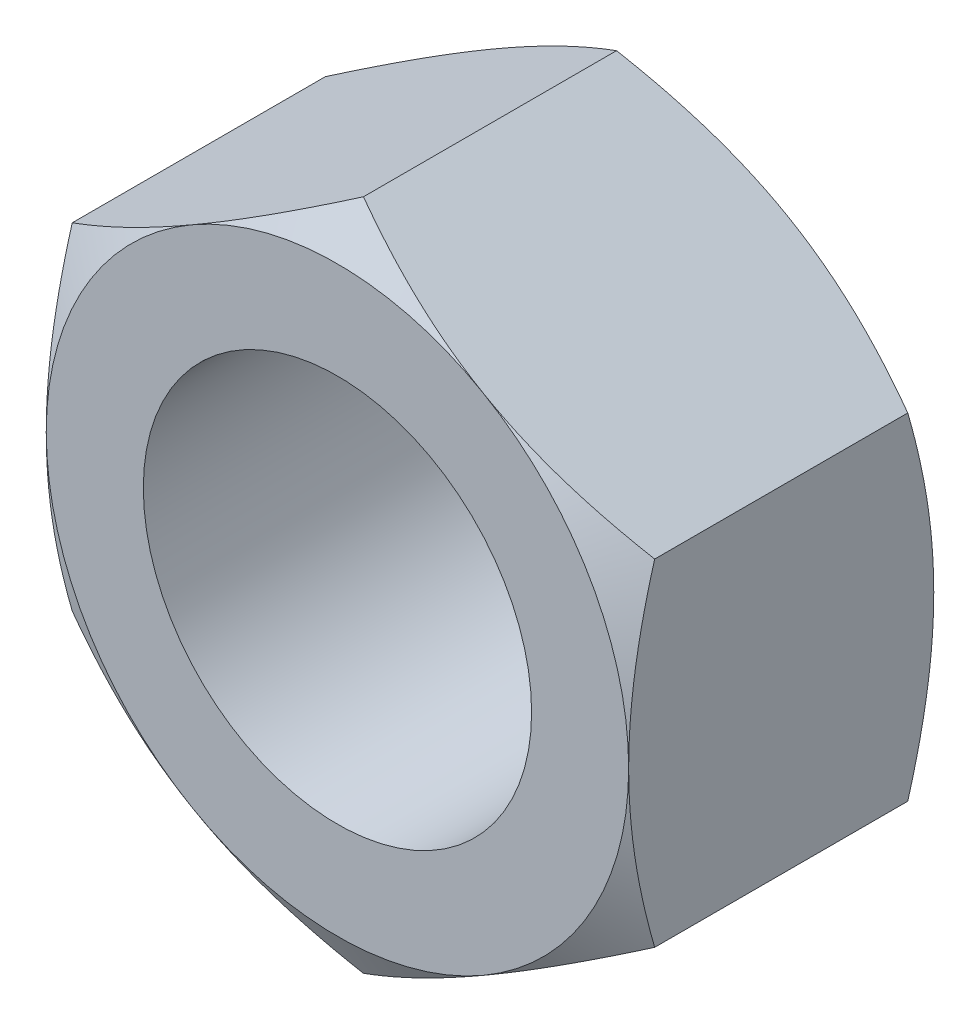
ISO-10303-21;
HEADER;
FILE_DESCRIPTION(('STEP AP214'),'2;1');
FILE_NAME('part.step','',(''),(''),'','','');
FILE_SCHEMA(('AUTOMOTIVE_DESIGN { 1 0 10303 214 1 1 1 1 }'));
ENDSEC;
DATA;
#1=APPLICATION_CONTEXT('core data for automotive mechanical design processes');
#2=APPLICATION_PROTOCOL_DEFINITION('international standard','automotive_design',2000,#1);
#3=PRODUCT_CONTEXT('',#1,'mechanical');
#4=PRODUCT('Part','Part','',(#3));
#5=PRODUCT_RELATED_PRODUCT_CATEGORY('part','',(#4));
#6=PRODUCT_DEFINITION_FORMATION('','',#4);
#7=PRODUCT_DEFINITION_CONTEXT('part definition',#1,'design');
#8=PRODUCT_DEFINITION('design','',#6,#7);
#9=PRODUCT_DEFINITION_SHAPE('','',#8);
#10=(LENGTH_UNIT() NAMED_UNIT(*) SI_UNIT(.MILLI.,.METRE.));
#11=(NAMED_UNIT(*) PLANE_ANGLE_UNIT() SI_UNIT($,.RADIAN.));
#12=(NAMED_UNIT(*) SI_UNIT($,.STERADIAN.) SOLID_ANGLE_UNIT());
#13=UNCERTAINTY_MEASURE_WITH_UNIT(LENGTH_MEASURE(1.E-05),#10,'distance_accuracy_value','');
#14=(GEOMETRIC_REPRESENTATION_CONTEXT(3) GLOBAL_UNCERTAINTY_ASSIGNED_CONTEXT((#13)) GLOBAL_UNIT_ASSIGNED_CONTEXT((#10,
#11,#12)) REPRESENTATION_CONTEXT('',''));
#15=CARTESIAN_POINT('',(0.,0.,0.));
#16=DIRECTION('',(0.,0.,1.));
#17=DIRECTION('',(1.,0.,0.));
#18=AXIS2_PLACEMENT_3D('',#15,#16,#17);
#19=CARTESIAN_POINT('',(-10.5,18.1865334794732,0.));
#20=DIRECTION('',(0.,0.,-1.));
#21=DIRECTION('',(-1.,0.,0.));
#22=AXIS2_PLACEMENT_3D('',#19,#20,#21);
#23=PLANE('',#22);
#24=CARTESIAN_POINT('',(0.,0.,0.));
#25=DIRECTION('',(0.,0.,1.));
#26=DIRECTION('',(1.,0.,0.));
#27=AXIS2_PLACEMENT_3D('',#24,#25,#26);
#28=CIRCLE('',#27,7.);
#29=CARTESIAN_POINT('',(7.,0.,0.));
#30=VERTEX_POINT('',#29);
#31=EDGE_CURVE('E318',#30,#30,#28,.T.);
#32=ORIENTED_EDGE('',*,*,#31,.F.);
#33=EDGE_LOOP('',(#32));
#34=FACE_BOUND('',#33,.T.);
#35=CARTESIAN_POINT('',(0.,0.,0.));
#36=DIRECTION('',(0.,0.,-1.));
#37=DIRECTION('',(-1.,0.,0.));
#38=AXIS2_PLACEMENT_3D('',#35,#36,#37);
#39=CIRCLE('',#38,10.5);
#40=CARTESIAN_POINT('',(-10.5,0.,0.));
#41=VERTEX_POINT('',#40);
#42=CARTESIAN_POINT('',(-5.25,9.09326673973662,0.));
#43=VERTEX_POINT('',#42);
#44=EDGE_CURVE('E326',#41,#43,#39,.T.);
#45=ORIENTED_EDGE('',*,*,#44,.F.);
#46=CARTESIAN_POINT('',(0.,0.,0.));
#47=DIRECTION('',(0.,0.,-1.));
#48=DIRECTION('',(-1.,0.,0.));
#49=AXIS2_PLACEMENT_3D('',#46,#47,#48);
#50=CIRCLE('',#49,10.5);
#51=CARTESIAN_POINT('',(-5.24999999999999,-9.09326673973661,0.));
#52=VERTEX_POINT('',#51);
#53=EDGE_CURVE('E148',#41,#52,#50,.F.);
#54=ORIENTED_EDGE('',*,*,#53,.T.);
#55=CARTESIAN_POINT('',(5.24999999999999,-9.09326673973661,0.));
#56=VERTEX_POINT('',#55);
#57=EDGE_CURVE('E250',#52,#56,#50,.F.);
#58=ORIENTED_EDGE('',*,*,#57,.T.);
#59=CARTESIAN_POINT('',(10.5,0.,0.));
#60=VERTEX_POINT('',#59);
#61=EDGE_CURVE('E151',#56,#60,#50,.F.);
#62=ORIENTED_EDGE('',*,*,#61,.T.);
#63=CARTESIAN_POINT('',(5.24999999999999,9.09326673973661,0.));
#64=VERTEX_POINT('',#63);
#65=EDGE_CURVE('E126',#60,#64,#50,.F.);
#66=ORIENTED_EDGE('',*,*,#65,.T.);
#67=EDGE_CURVE('E139',#64,#43,#50,.F.);
#68=ORIENTED_EDGE('',*,*,#67,.T.);
#69=EDGE_LOOP('',(#45,#54,#58,#62,#66,#68));
#70=FACE_BOUND('',#69,.T.);
#71=ADVANCED_FACE('F31',(#34,#70),#23,.F.);
#72=CARTESIAN_POINT('',(0.,0.,0.));
#73=DIRECTION('',(0.,0.,-1.));
#74=DIRECTION('',(-1.,0.,0.));
#75=AXIS2_PLACEMENT_3D('',#72,#73,#74);
#76=CONICAL_SURFACE('',#75,10.5,1.0471975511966);
#77=CARTESIAN_POINT('',(-10.5,-16.3305051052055,-5.14697612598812));
#78=CARTESIAN_POINT('',(-10.5,-16.1009817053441,-5.03551486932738));
#79=CARTESIAN_POINT('',(-10.5,-15.8711901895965,-4.92460597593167));
#80=CARTESIAN_POINT('',(-10.5,-15.4110149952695,-4.70401794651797));
#81=CARTESIAN_POINT('',(-10.5,-15.1806313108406,-4.59433882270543));
#82=CARTESIAN_POINT('',(-10.5,-14.488447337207,-4.26730501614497));
#83=CARTESIAN_POINT('',(-10.5,-14.0256813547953,-4.05198663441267));
#84=CARTESIAN_POINT('',(-10.5,-13.0945721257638,-3.62692466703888));
#85=CARTESIAN_POINT('',(-10.5,-12.6262122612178,-3.41721739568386));
#86=CARTESIAN_POINT('',(-10.5,-11.6857837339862,-3.00632125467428));
#87=CARTESIAN_POINT('',(-10.5,-11.2137152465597,-2.80513198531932));
#88=CARTESIAN_POINT('',(-10.5,-10.24983556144,-2.40721614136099));
#89=CARTESIAN_POINT('',(-10.5,-9.75787811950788,-2.21084188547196));
#90=CARTESIAN_POINT('',(-10.5,-8.76822664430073,-1.83284251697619));
#91=CARTESIAN_POINT('',(-10.5,-8.27053197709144,-1.65121905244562));
#92=CARTESIAN_POINT('',(-10.5,-7.26952397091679,-1.30745481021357));
#93=CARTESIAN_POINT('',(-10.5,-6.76622417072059,-1.14527503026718));
#94=CARTESIAN_POINT('',(-10.5,-5.75242380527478,-0.845568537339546));
#95=CARTESIAN_POINT('',(-10.5,-5.24192554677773,-0.708034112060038));
#96=CARTESIAN_POINT('',(-10.5,-4.21612600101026,-0.464912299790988));
#97=CARTESIAN_POINT('',(-10.5,-3.70086630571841,-0.359154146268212));
#98=CARTESIAN_POINT('',(-10.5,-2.92324815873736,-0.228919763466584));
#99=CARTESIAN_POINT('',(-10.5,-2.66323567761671,-0.19024040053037));
#100=CARTESIAN_POINT('',(-10.5,-2.14190246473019,-0.123106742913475));
#101=CARTESIAN_POINT('',(-10.5,-1.88058186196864,-0.0946514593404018));
#102=CARTESIAN_POINT('',(-10.5,-1.36041912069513,-0.0488924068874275));
#103=CARTESIAN_POINT('',(-10.5,-1.10158947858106,-0.0314471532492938));
#104=CARTESIAN_POINT('',(-10.5,-0.583424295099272,-0.00752008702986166));
#105=CARTESIAN_POINT('',(-10.5,-0.32408876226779,-0.00103809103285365));
#106=CARTESIAN_POINT('',(-10.5,0.194626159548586,0.000807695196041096));
#107=CARTESIAN_POINT('',(-10.5,0.454005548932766,-0.00382862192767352));
#108=CARTESIAN_POINT('',(-10.5,0.972337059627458,-0.024105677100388));
#109=CARTESIAN_POINT('',(-10.5,1.23128915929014,-0.0397469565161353));
#110=CARTESIAN_POINT('',(-10.5,1.85209820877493,-0.0901048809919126));
#111=CARTESIAN_POINT('',(-10.5,2.21354744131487,-0.129957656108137));
#112=CARTESIAN_POINT('',(-10.5,2.93377792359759,-0.228941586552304));
#113=CARTESIAN_POINT('',(-10.5,3.2925588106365,-0.288075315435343));
#114=CARTESIAN_POINT('',(-10.5,4.36447068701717,-0.491263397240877));
#115=CARTESIAN_POINT('',(-10.5,5.07278568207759,-0.661069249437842));
#116=CARTESIAN_POINT('',(-10.5,6.13220325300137,-0.955778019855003));
#117=CARTESIAN_POINT('',(-10.5,6.48879049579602,-1.06209963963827));
#118=CARTESIAN_POINT('',(-10.5,7.19850081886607,-1.2858394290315));
#119=CARTESIAN_POINT('',(-10.5,7.55162387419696,-1.40325767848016));
#120=CARTESIAN_POINT('',(-10.5,8.25451908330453,-1.64730188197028));
#121=CARTESIAN_POINT('',(-10.5,8.60429226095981,-1.77392491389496));
#122=CARTESIAN_POINT('',(-10.5,9.30093361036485,-2.03488310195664));
#123=CARTESIAN_POINT('',(-10.5,9.64780183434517,-2.16921811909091));
#124=CARTESIAN_POINT('',(-10.5,10.536648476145,-2.52299812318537));
#125=CARTESIAN_POINT('',(-10.5,11.0767414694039,-2.74717417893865));
#126=CARTESIAN_POINT('',(-10.5,12.1517768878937,-3.20759316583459));
#127=CARTESIAN_POINT('',(-10.5,12.6867188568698,-3.44383715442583));
#128=CARTESIAN_POINT('',(-10.5,13.7525527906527,-3.9256958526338));
#129=CARTESIAN_POINT('',(-10.5,14.2834434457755,-4.17131345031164));
#130=CARTESIAN_POINT('',(-10.5,15.3417752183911,-4.66980712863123));
#131=CARTESIAN_POINT('',(-10.5,15.8692164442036,-4.92268297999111));
#132=CARTESIAN_POINT('',(-10.5,16.9220169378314,-5.43454632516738));
#133=CARTESIAN_POINT('',(-10.5,17.4473723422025,-5.69354174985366));
#134=CARTESIAN_POINT('',(-10.5,18.4957707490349,-6.2161724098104));
#135=CARTESIAN_POINT('',(-10.5,19.0188137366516,-6.47980767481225));
#136=CARTESIAN_POINT('',(-10.5,20.0628862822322,-7.01080154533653));
#137=CARTESIAN_POINT('',(-10.5,20.5839161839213,-7.27815947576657));
#138=CARTESIAN_POINT('',(-10.5,21.6243716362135,-7.81598079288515));
#139=CARTESIAN_POINT('',(-10.5,22.1437971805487,-8.0864441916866));
#140=CARTESIAN_POINT('',(-10.5,23.599352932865,-8.84893384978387));
#141=CARTESIAN_POINT('',(-10.5,24.5339618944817,-9.34386369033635));
#142=CARTESIAN_POINT('',(-10.5,26.3999511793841,-10.3398692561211));
#143=CARTESIAN_POINT('',(-10.5,27.3313313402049,-10.8409452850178));
#144=CARTESIAN_POINT('',(-10.5,29.1888362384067,-11.8462361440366));
#145=CARTESIAN_POINT('',(-10.5,30.1149683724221,-12.3504373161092));
#146=CARTESIAN_POINT('',(-10.5,31.5026761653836,-13.1093876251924));
#147=CARTESIAN_POINT('',(-10.5,31.964981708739,-13.3628040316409));
#148=CARTESIAN_POINT('',(-10.5,32.8891570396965,-13.8704287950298));
#149=CARTESIAN_POINT('',(-10.5,33.351026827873,-14.1246371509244));
#150=CARTESIAN_POINT('',(-10.5,33.812704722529,-14.3791936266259));
#151=B_SPLINE_CURVE_WITH_KNOTS('',3,(#77,#78,#79,#80,#81,#82,#83,#84,#85,#86,#87,#88,#89,#90,
#91,#92,#93,#94,#95,#96,#97,#98,#99,#100,#101,#102,#103,#104,#105,#106,#107,#108,#109,#110,#111,
#112,#113,#114,#115,#116,#117,#118,#119,#120,#121,#122,#123,#124,#125,#126,#127,#128,#129,#130,
#131,#132,#133,#134,#135,#136,#137,#138,#139,#140,#141,#142,#143,#144,#145,#146,#147,#148,#149,
#150),.UNSPECIFIED.,.F.,.F.,(4,2,2,2,2,2,2,2,2,2,2,2,2,2,2,2,2,2,2,2,2,2,2,2,2,2,2,2,2,2,2,2,2,
2,2,2,4),(0.,0.765466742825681,1.53094107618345,3.06211405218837,4.60154212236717,
6.14089787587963,7.72982255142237,9.31892451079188,10.904783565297,12.4901454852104,
14.066828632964,14.8552803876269,15.6436558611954,16.4216821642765,17.1996954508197,
17.9777162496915,18.7557753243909,19.8460795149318,20.9365292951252,23.1185841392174,
24.2347912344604,25.3510063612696,26.4668686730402,27.5827108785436,29.3368077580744,
31.0910586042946,32.8458543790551,34.6005947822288,36.3577497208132,38.1149159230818,
39.8717675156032,41.6286259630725,44.8012937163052,47.9741188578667,51.1375644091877,
52.7191821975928,54.3007978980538),.UNSPECIFIED.);
#152=CARTESIAN_POINT('',(-10.5,6.06217782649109,-0.937822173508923));
#153=VERTEX_POINT('',#152);
#154=EDGE_CURVE('E156',#153,#41,#151,.F.);
#155=ORIENTED_EDGE('',*,*,#154,.T.);
#156=ORIENTED_EDGE('',*,*,#44,.T.);
#157=CARTESIAN_POINT('',(0.0002,12.124471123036,-0.937888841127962));
#158=CARTESIAN_POINT('',(-0.230612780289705,11.9912113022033,-0.860963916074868));
#159=CARTESIAN_POINT('',(-0.462286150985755,11.8574546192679,-0.78753038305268));
#160=CARTESIAN_POINT('',(-0.927490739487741,11.588868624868,-0.648614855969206));
#161=CARTESIAN_POINT('',(-1.16102254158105,11.4540389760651,-0.583135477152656));
#162=CARTESIAN_POINT('',(-1.86538084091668,11.0473775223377,-0.399895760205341));
#163=CARTESIAN_POINT('',(-2.33898788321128,10.7739403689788,-0.295669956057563));
#164=CARTESIAN_POINT('',(-3.04771913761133,10.3647541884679,-0.173455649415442));
#165=CARTESIAN_POINT('',(-3.28072597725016,10.2302276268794,-0.138641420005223));
#166=CARTESIAN_POINT('',(-3.74781845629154,9.96055165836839,-0.0802602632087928));
#167=CARTESIAN_POINT('',(-3.98190411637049,9.82540223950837,-0.0566935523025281));
#168=CARTESIAN_POINT('',(-4.45046590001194,9.55487796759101,-0.0214112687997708));
#169=CARTESIAN_POINT('',(-4.68494122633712,9.41950357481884,-0.00968161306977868));
#170=CARTESIAN_POINT('',(-5.15410845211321,9.14862975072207,0.00167731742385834));
#171=CARTESIAN_POINT('',(-5.38880034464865,9.01313032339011,0.00130696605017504));
#172=CARTESIAN_POINT('',(-5.82756124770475,8.75981159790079,-0.0106922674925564));
#173=CARTESIAN_POINT('',(-6.03166122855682,8.64197441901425,-0.0208573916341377));
#174=CARTESIAN_POINT('',(-6.43938384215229,8.40657565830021,-0.0501416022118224));
#175=CARTESIAN_POINT('',(-6.64300644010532,8.28901409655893,-0.0692613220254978));
#176=CARTESIAN_POINT('',(-7.25308524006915,7.93678493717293,-0.139600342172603));
#177=CARTESIAN_POINT('',(-7.65846156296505,7.70274080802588,-0.203790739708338));
#178=CARTESIAN_POINT('',(-8.47351422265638,7.23216993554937,-0.364267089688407));
#179=CARTESIAN_POINT('',(-8.88308654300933,6.99570324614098,-0.461233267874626));
#180=CARTESIAN_POINT('',(-9.6961235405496,6.52629611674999,-0.681306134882));
#181=CARTESIAN_POINT('',(-10.0995986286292,6.29334966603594,-0.804361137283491));
#182=CARTESIAN_POINT('',(-10.5002,6.06206235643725,-0.937888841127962));
#183=B_SPLINE_CURVE_WITH_KNOTS('',3,(#157,#158,#159,#160,#161,#162,#163,#164,#165,#166,#167,
#168,#169,#170,#171,#172,#173,#174,#175,#176,#177,#178,#179,#180,#181,#182),.UNSPECIFIED.,.F.,
.F.,(4,2,2,2,2,2,2,2,2,2,2,2,4),(0.,0.83213025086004,1.66453336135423,3.33288308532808,
4.14658222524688,4.9602970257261,5.77304256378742,6.58576298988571,7.29326708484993,
8.00082123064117,9.4169349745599,10.864454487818,12.3091325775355),.UNSPECIFIED.);
#184=EDGE_CURVE('E188',#43,#153,#183,.T.);
#185=ORIENTED_EDGE('',*,*,#184,.T.);
#186=EDGE_LOOP('',(#155,#156,#185));
#187=FACE_BOUND('',#186,.T.);
#188=ADVANCED_FACE('F175',(#187),#76,.T.);
#189=CARTESIAN_POINT('',(10.5002,6.06206235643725,-0.937888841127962));
#190=CARTESIAN_POINT('',(10.2693872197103,6.19532217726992,-0.860963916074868));
#191=CARTESIAN_POINT('',(10.0377138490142,6.32907886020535,-0.787530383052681));
#192=CARTESIAN_POINT('',(9.57250926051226,6.59766485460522,-0.648614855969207));
#193=CARTESIAN_POINT('',(9.33897745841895,6.73249450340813,-0.583135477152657));
#194=CARTESIAN_POINT('',(8.63461915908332,7.13915595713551,-0.399895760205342));
#195=CARTESIAN_POINT('',(8.16101211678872,7.41259311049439,-0.295669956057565));
#196=CARTESIAN_POINT('',(7.45228086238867,7.82177929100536,-0.173455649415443));
#197=CARTESIAN_POINT('',(7.21927402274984,7.95630585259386,-0.138641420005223));
#198=CARTESIAN_POINT('',(6.75218154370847,8.22598182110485,-0.0802602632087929));
#199=CARTESIAN_POINT('',(6.51809588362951,8.36113123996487,-0.0566935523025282));
#200=CARTESIAN_POINT('',(6.04953409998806,8.63165551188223,-0.0214112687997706));
#201=CARTESIAN_POINT('',(5.81505877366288,8.7670299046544,-0.00968161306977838));
#202=CARTESIAN_POINT('',(5.34589154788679,9.03790372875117,0.00167731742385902));
#203=CARTESIAN_POINT('',(5.11119965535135,9.17340315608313,0.00130696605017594));
#204=CARTESIAN_POINT('',(4.67243875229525,9.42672188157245,-0.0106922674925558));
#205=CARTESIAN_POINT('',(4.46833877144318,9.54455906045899,-0.0208573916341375));
#206=CARTESIAN_POINT('',(4.06061615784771,9.77995782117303,-0.0501416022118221));
#207=CARTESIAN_POINT('',(3.85699355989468,9.89751938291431,-0.0692613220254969));
#208=CARTESIAN_POINT('',(3.24691475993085,10.2497485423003,-0.139600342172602));
#209=CARTESIAN_POINT('',(2.84153843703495,10.4837926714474,-0.203790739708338));
#210=CARTESIAN_POINT('',(2.02648577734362,10.9543635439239,-0.364267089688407));
#211=CARTESIAN_POINT('',(1.61691345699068,11.1908302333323,-0.461233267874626));
#212=CARTESIAN_POINT('',(0.803876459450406,11.6602373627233,-0.681306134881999));
#213=CARTESIAN_POINT('',(0.400401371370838,11.8931838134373,-0.80436113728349));
#214=CARTESIAN_POINT('',(-0.000199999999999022,12.124471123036,-0.937888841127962));
#215=B_SPLINE_CURVE_WITH_KNOTS('',3,(#189,#190,#191,#192,#193,#194,#195,#196,#197,#198,#199,
#200,#201,#202,#203,#204,#205,#206,#207,#208,#209,#210,#211,#212,#213,#214),.UNSPECIFIED.,.F.,
.F.,(4,2,2,2,2,2,2,2,2,2,2,2,4),(0.,0.832130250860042,1.66453336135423,3.33288308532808,
4.14658222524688,4.9602970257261,5.77304256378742,6.58576298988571,7.29326708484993,
8.00082123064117,9.4169349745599,10.864454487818,12.3091325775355),.UNSPECIFIED.);
#216=CARTESIAN_POINT('',(0.,12.1243556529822,-0.937822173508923));
#217=VERTEX_POINT('',#216);
#218=EDGE_CURVE('E135',#64,#217,#215,.T.);
#219=ORIENTED_EDGE('',*,*,#218,.T.);
#220=EDGE_CURVE('E142',#217,#43,#183,.T.);
#221=ORIENTED_EDGE('',*,*,#220,.T.);
#222=ORIENTED_EDGE('',*,*,#67,.F.);
#223=EDGE_LOOP('',(#219,#221,#222));
#224=FACE_BOUND('',#223,.T.);
#225=ADVANCED_FACE('F140',(#224),#76,.T.);
#226=CARTESIAN_POINT('',(10.5,-16.3305051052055,-5.14697612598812));
#227=CARTESIAN_POINT('',(10.5,-16.1009817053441,-5.03551486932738));
#228=CARTESIAN_POINT('',(10.5,-15.8711901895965,-4.92460597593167));
#229=CARTESIAN_POINT('',(10.5,-15.4110149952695,-4.70401794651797));
#230=CARTESIAN_POINT('',(10.5,-15.1806313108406,-4.59433882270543));
#231=CARTESIAN_POINT('',(10.5,-14.488447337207,-4.26730501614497));
#232=CARTESIAN_POINT('',(10.5,-14.0256813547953,-4.05198663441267));
#233=CARTESIAN_POINT('',(10.5,-13.0945721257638,-3.62692466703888));
#234=CARTESIAN_POINT('',(10.5,-12.6262122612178,-3.41721739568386));
#235=CARTESIAN_POINT('',(10.5,-11.6857837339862,-3.00632125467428));
#236=CARTESIAN_POINT('',(10.5,-11.2137152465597,-2.80513198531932));
#237=CARTESIAN_POINT('',(10.5,-10.24983556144,-2.40721614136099));
#238=CARTESIAN_POINT('',(10.5,-9.75787811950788,-2.21084188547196));
#239=CARTESIAN_POINT('',(10.5,-8.76822664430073,-1.83284251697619));
#240=CARTESIAN_POINT('',(10.5,-8.27053197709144,-1.65121905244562));
#241=CARTESIAN_POINT('',(10.5,-7.26952397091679,-1.30745481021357));
#242=CARTESIAN_POINT('',(10.5,-6.76622417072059,-1.14527503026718));
#243=CARTESIAN_POINT('',(10.5,-5.75242380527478,-0.845568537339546));
#244=CARTESIAN_POINT('',(10.5,-5.24192554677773,-0.708034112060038));
#245=CARTESIAN_POINT('',(10.5,-4.21612600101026,-0.464912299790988));
#246=CARTESIAN_POINT('',(10.5,-3.70086630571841,-0.359154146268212));
#247=CARTESIAN_POINT('',(10.5,-2.92324815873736,-0.228919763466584));
#248=CARTESIAN_POINT('',(10.5,-2.66323567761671,-0.19024040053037));
#249=CARTESIAN_POINT('',(10.5,-2.14190246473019,-0.123106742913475));
#250=CARTESIAN_POINT('',(10.5,-1.88058186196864,-0.0946514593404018));
#251=CARTESIAN_POINT('',(10.5,-1.36041912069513,-0.0488924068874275));
#252=CARTESIAN_POINT('',(10.5,-1.10158947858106,-0.0314471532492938));
#253=CARTESIAN_POINT('',(10.5,-0.583424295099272,-0.00752008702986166));
#254=CARTESIAN_POINT('',(10.5,-0.32408876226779,-0.00103809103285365));
#255=CARTESIAN_POINT('',(10.5,0.194626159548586,0.000807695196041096));
#256=CARTESIAN_POINT('',(10.5,0.454005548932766,-0.00382862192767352));
#257=CARTESIAN_POINT('',(10.5,0.972337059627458,-0.024105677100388));
#258=CARTESIAN_POINT('',(10.5,1.23128915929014,-0.0397469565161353));
#259=CARTESIAN_POINT('',(10.5,1.85209820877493,-0.0901048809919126));
#260=CARTESIAN_POINT('',(10.5,2.21354744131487,-0.129957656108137));
#261=CARTESIAN_POINT('',(10.5,2.93377792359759,-0.228941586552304));
#262=CARTESIAN_POINT('',(10.5,3.2925588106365,-0.288075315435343));
#263=CARTESIAN_POINT('',(10.5,4.36447068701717,-0.491263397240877));
#264=CARTESIAN_POINT('',(10.5,5.07278568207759,-0.661069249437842));
#265=CARTESIAN_POINT('',(10.5,6.13220325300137,-0.955778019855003));
#266=CARTESIAN_POINT('',(10.5,6.48879049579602,-1.06209963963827));
#267=CARTESIAN_POINT('',(10.5,7.19850081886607,-1.2858394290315));
#268=CARTESIAN_POINT('',(10.5,7.55162387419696,-1.40325767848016));
#269=CARTESIAN_POINT('',(10.5,8.25451908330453,-1.64730188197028));
#270=CARTESIAN_POINT('',(10.5,8.60429226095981,-1.77392491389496));
#271=CARTESIAN_POINT('',(10.5,9.30093361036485,-2.03488310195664));
#272=CARTESIAN_POINT('',(10.5,9.64780183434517,-2.16921811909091));
#273=CARTESIAN_POINT('',(10.5,10.536648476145,-2.52299812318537));
#274=CARTESIAN_POINT('',(10.5,11.0767414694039,-2.74717417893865));
#275=CARTESIAN_POINT('',(10.5,12.1517768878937,-3.20759316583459));
#276=CARTESIAN_POINT('',(10.5,12.6867188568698,-3.44383715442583));
#277=CARTESIAN_POINT('',(10.5,13.7525527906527,-3.9256958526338));
#278=CARTESIAN_POINT('',(10.5,14.2834434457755,-4.17131345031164));
#279=CARTESIAN_POINT('',(10.5,15.3417752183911,-4.66980712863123));
#280=CARTESIAN_POINT('',(10.5,15.8692164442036,-4.92268297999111));
#281=CARTESIAN_POINT('',(10.5,16.9220169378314,-5.43454632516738));
#282=CARTESIAN_POINT('',(10.5,17.4473723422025,-5.69354174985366));
#283=CARTESIAN_POINT('',(10.5,18.4957707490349,-6.2161724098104));
#284=CARTESIAN_POINT('',(10.5,19.0188137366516,-6.47980767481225));
#285=CARTESIAN_POINT('',(10.5,20.0628862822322,-7.01080154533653));
#286=CARTESIAN_POINT('',(10.5,20.5839161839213,-7.27815947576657));
#287=CARTESIAN_POINT('',(10.5,21.6243716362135,-7.81598079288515));
#288=CARTESIAN_POINT('',(10.5,22.1437971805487,-8.0864441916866));
#289=CARTESIAN_POINT('',(10.5,23.599352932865,-8.84893384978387));
#290=CARTESIAN_POINT('',(10.5,24.5339618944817,-9.34386369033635));
#291=CARTESIAN_POINT('',(10.5,26.3999511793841,-10.3398692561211));
#292=CARTESIAN_POINT('',(10.5,27.3313313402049,-10.8409452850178));
#293=CARTESIAN_POINT('',(10.5,29.1888362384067,-11.8462361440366));
#294=CARTESIAN_POINT('',(10.5,30.1149683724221,-12.3504373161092));
#295=CARTESIAN_POINT('',(10.5,31.5026761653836,-13.1093876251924));
#296=CARTESIAN_POINT('',(10.5,31.964981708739,-13.3628040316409));
#297=CARTESIAN_POINT('',(10.5,32.8891570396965,-13.8704287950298));
#298=CARTESIAN_POINT('',(10.5,33.351026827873,-14.1246371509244));
#299=CARTESIAN_POINT('',(10.5,33.812704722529,-14.3791936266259));
#300=B_SPLINE_CURVE_WITH_KNOTS('',3,(#226,#227,#228,#229,#230,#231,#232,#233,#234,#235,#236,
#237,#238,#239,#240,#241,#242,#243,#244,#245,#246,#247,#248,#249,#250,#251,#252,#253,#254,#255,
#256,#257,#258,#259,#260,#261,#262,#263,#264,#265,#266,#267,#268,#269,#270,#271,#272,#273,#274,
#275,#276,#277,#278,#279,#280,#281,#282,#283,#284,#285,#286,#287,#288,#289,#290,#291,#292,#293,
#294,#295,#296,#297,#298,#299),.UNSPECIFIED.,.F.,.F.,(4,2,2,2,2,2,2,2,2,2,2,2,2,2,2,2,2,2,2,2,2,
2,2,2,2,2,2,2,2,2,2,2,2,2,2,2,4),(0.,0.765466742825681,1.53094107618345,3.06211405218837,
4.60154212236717,6.14089787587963,7.72982255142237,9.31892451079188,10.904783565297,
12.4901454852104,14.066828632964,14.8552803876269,15.6436558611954,16.4216821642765,
17.1996954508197,17.9777162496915,18.7557753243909,19.8460795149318,20.9365292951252,
23.1185841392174,24.2347912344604,25.3510063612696,26.4668686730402,27.5827108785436,
29.3368077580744,31.0910586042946,32.8458543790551,34.6005947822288,36.3577497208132,
38.1149159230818,39.8717675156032,41.6286259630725,44.8012937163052,47.9741188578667,
51.1375644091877,52.7191821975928,54.3007978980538),.UNSPECIFIED.);
#301=CARTESIAN_POINT('',(10.5,6.06217782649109,-0.937822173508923));
#302=VERTEX_POINT('',#301);
#303=EDGE_CURVE('E129',#60,#302,#300,.T.);
#304=ORIENTED_EDGE('',*,*,#303,.T.);
#305=EDGE_CURVE('E122',#302,#64,#215,.T.);
#306=ORIENTED_EDGE('',*,*,#305,.T.);
#307=ORIENTED_EDGE('',*,*,#65,.F.);
#308=EDGE_LOOP('',(#304,#306,#307));
#309=FACE_BOUND('',#308,.T.);
#310=ADVANCED_FACE('F124',(#309),#76,.T.);
#311=CARTESIAN_POINT('',(-0.0002,-12.124471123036,-0.937888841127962));
#312=CARTESIAN_POINT('',(0.230612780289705,-11.9912113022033,-0.860963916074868));
#313=CARTESIAN_POINT('',(0.462286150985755,-11.8574546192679,-0.78753038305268));
#314=CARTESIAN_POINT('',(0.927490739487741,-11.588868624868,-0.648614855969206));
#315=CARTESIAN_POINT('',(1.16102254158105,-11.4540389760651,-0.583135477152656));
#316=CARTESIAN_POINT('',(1.86538084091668,-11.0473775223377,-0.399895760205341));
#317=CARTESIAN_POINT('',(2.33898788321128,-10.7739403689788,-0.295669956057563));
#318=CARTESIAN_POINT('',(3.04771913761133,-10.3647541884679,-0.173455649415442));
#319=CARTESIAN_POINT('',(3.28072597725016,-10.2302276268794,-0.138641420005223));
#320=CARTESIAN_POINT('',(3.74781845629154,-9.96055165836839,-0.0802602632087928));
#321=CARTESIAN_POINT('',(3.98190411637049,-9.82540223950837,-0.0566935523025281));
#322=CARTESIAN_POINT('',(4.45046590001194,-9.55487796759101,-0.0214112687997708));
#323=CARTESIAN_POINT('',(4.68494122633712,-9.41950357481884,-0.00968161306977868));
#324=CARTESIAN_POINT('',(5.15410845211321,-9.14862975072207,0.00167731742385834));
#325=CARTESIAN_POINT('',(5.38880034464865,-9.01313032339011,0.00130696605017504));
#326=CARTESIAN_POINT('',(5.82756124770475,-8.75981159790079,-0.0106922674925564));
#327=CARTESIAN_POINT('',(6.03166122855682,-8.64197441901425,-0.0208573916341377));
#328=CARTESIAN_POINT('',(6.43938384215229,-8.40657565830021,-0.0501416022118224));
#329=CARTESIAN_POINT('',(6.64300644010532,-8.28901409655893,-0.0692613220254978));
#330=CARTESIAN_POINT('',(7.25308524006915,-7.93678493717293,-0.139600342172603));
#331=CARTESIAN_POINT('',(7.65846156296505,-7.70274080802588,-0.203790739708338));
#332=CARTESIAN_POINT('',(8.47351422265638,-7.23216993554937,-0.364267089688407));
#333=CARTESIAN_POINT('',(8.88308654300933,-6.99570324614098,-0.461233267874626));
#334=CARTESIAN_POINT('',(9.6961235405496,-6.52629611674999,-0.681306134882));
#335=CARTESIAN_POINT('',(10.0995986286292,-6.29334966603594,-0.804361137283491));
#336=CARTESIAN_POINT('',(10.5002,-6.06206235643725,-0.937888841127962));
#337=B_SPLINE_CURVE_WITH_KNOTS('',3,(#311,#312,#313,#314,#315,#316,#317,#318,#319,#320,#321,
#322,#323,#324,#325,#326,#327,#328,#329,#330,#331,#332,#333,#334,#335,#336),.UNSPECIFIED.,.F.,
.F.,(4,2,2,2,2,2,2,2,2,2,2,2,4),(0.,0.83213025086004,1.66453336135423,3.33288308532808,
4.14658222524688,4.9602970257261,5.77304256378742,6.58576298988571,7.29326708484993,
8.00082123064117,9.4169349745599,10.864454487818,12.3091325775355),.UNSPECIFIED.);
#338=CARTESIAN_POINT('',(10.5,-6.06217782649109,-0.937822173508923));
#339=VERTEX_POINT('',#338);
#340=EDGE_CURVE('E202',#56,#339,#337,.T.);
#341=ORIENTED_EDGE('',*,*,#340,.T.);
#342=EDGE_CURVE('E201',#339,#60,#300,.T.);
#343=ORIENTED_EDGE('',*,*,#342,.T.);
#344=ORIENTED_EDGE('',*,*,#61,.F.);
#345=EDGE_LOOP('',(#341,#343,#344));
#346=FACE_BOUND('',#345,.T.);
#347=ADVANCED_FACE('F426',(#346),#76,.T.);
#348=CARTESIAN_POINT('',(0.,-12.1243556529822,-0.937822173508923));
#349=VERTEX_POINT('',#348);
#350=EDGE_CURVE('E260',#349,#56,#337,.T.);
#351=ORIENTED_EDGE('',*,*,#350,.T.);
#352=ORIENTED_EDGE('',*,*,#57,.F.);
#353=CARTESIAN_POINT('',(-10.5002,-6.06206235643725,-0.937888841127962));
#354=CARTESIAN_POINT('',(-10.2693872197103,-6.19532217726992,-0.860963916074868));
#355=CARTESIAN_POINT('',(-10.0377138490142,-6.32907886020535,-0.787530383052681));
#356=CARTESIAN_POINT('',(-9.57250926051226,-6.59766485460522,-0.648614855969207));
#357=CARTESIAN_POINT('',(-9.33897745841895,-6.73249450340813,-0.583135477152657));
#358=CARTESIAN_POINT('',(-8.63461915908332,-7.13915595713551,-0.399895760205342));
#359=CARTESIAN_POINT('',(-8.16101211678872,-7.41259311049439,-0.295669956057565));
#360=CARTESIAN_POINT('',(-7.45228086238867,-7.82177929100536,-0.173455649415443));
#361=CARTESIAN_POINT('',(-7.21927402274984,-7.95630585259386,-0.138641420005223));
#362=CARTESIAN_POINT('',(-6.75218154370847,-8.22598182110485,-0.0802602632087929));
#363=CARTESIAN_POINT('',(-6.51809588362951,-8.36113123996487,-0.0566935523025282));
#364=CARTESIAN_POINT('',(-6.04953409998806,-8.63165551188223,-0.0214112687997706));
#365=CARTESIAN_POINT('',(-5.81505877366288,-8.7670299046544,-0.00968161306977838));
#366=CARTESIAN_POINT('',(-5.34589154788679,-9.03790372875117,0.00167731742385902));
#367=CARTESIAN_POINT('',(-5.11119965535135,-9.17340315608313,0.00130696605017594));
#368=CARTESIAN_POINT('',(-4.67243875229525,-9.42672188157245,-0.0106922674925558));
#369=CARTESIAN_POINT('',(-4.46833877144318,-9.54455906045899,-0.0208573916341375));
#370=CARTESIAN_POINT('',(-4.06061615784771,-9.77995782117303,-0.0501416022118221));
#371=CARTESIAN_POINT('',(-3.85699355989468,-9.89751938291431,-0.0692613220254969));
#372=CARTESIAN_POINT('',(-3.24691475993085,-10.2497485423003,-0.139600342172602));
#373=CARTESIAN_POINT('',(-2.84153843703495,-10.4837926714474,-0.203790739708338));
#374=CARTESIAN_POINT('',(-2.02648577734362,-10.9543635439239,-0.364267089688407));
#375=CARTESIAN_POINT('',(-1.61691345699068,-11.1908302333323,-0.461233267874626));
#376=CARTESIAN_POINT('',(-0.803876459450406,-11.6602373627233,-0.681306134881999));
#377=CARTESIAN_POINT('',(-0.400401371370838,-11.8931838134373,-0.80436113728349));
#378=CARTESIAN_POINT('',(0.000199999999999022,-12.124471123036,-0.937888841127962));
#379=B_SPLINE_CURVE_WITH_KNOTS('',3,(#353,#354,#355,#356,#357,#358,#359,#360,#361,#362,#363,
#364,#365,#366,#367,#368,#369,#370,#371,#372,#373,#374,#375,#376,#377,#378),.UNSPECIFIED.,.F.,
.F.,(4,2,2,2,2,2,2,2,2,2,2,2,4),(0.,0.832130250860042,1.66453336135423,3.33288308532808,
4.14658222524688,4.9602970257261,5.77304256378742,6.58576298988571,7.29326708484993,
8.00082123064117,9.4169349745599,10.864454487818,12.3091325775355),.UNSPECIFIED.);
#380=EDGE_CURVE('E264',#52,#349,#379,.T.);
#381=ORIENTED_EDGE('',*,*,#380,.T.);
#382=EDGE_LOOP('',(#351,#352,#381));
#383=FACE_BOUND('',#382,.T.);
#384=ADVANCED_FACE('F181',(#383),#76,.T.);
#385=CARTESIAN_POINT('',(-10.5,-6.06217782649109,-0.937822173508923));
#386=VERTEX_POINT('',#385);
#387=EDGE_CURVE('E169',#386,#52,#379,.T.);
#388=ORIENTED_EDGE('',*,*,#387,.T.);
#389=ORIENTED_EDGE('',*,*,#53,.F.);
#390=EDGE_CURVE('E134',#41,#386,#151,.F.);
#391=ORIENTED_EDGE('',*,*,#390,.T.);
#392=EDGE_LOOP('',(#388,#389,#391));
#393=FACE_BOUND('',#392,.T.);
#394=ADVANCED_FACE('F269',(#393),#76,.T.);
#395=CARTESIAN_POINT('',(10.5,6.06217782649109,-11.));
#396=DIRECTION('',(0.499999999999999,0.866025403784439,0.));
#397=DIRECTION('',(-0.866025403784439,0.499999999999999,0.));
#398=AXIS2_PLACEMENT_3D('',#395,#396,#397);
#399=PLANE('',#398);
#400=CARTESIAN_POINT('',(-0.0002,12.124471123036,-10.062111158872));
#401=CARTESIAN_POINT('',(0.230612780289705,11.9912113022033,-10.1390360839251));
#402=CARTESIAN_POINT('',(0.462286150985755,11.8574546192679,-10.2124696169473));
#403=CARTESIAN_POINT('',(0.927490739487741,11.588868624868,-10.3513851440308));
#404=CARTESIAN_POINT('',(1.16102254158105,11.4540389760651,-10.4168645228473));
#405=CARTESIAN_POINT('',(1.86538084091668,11.0473775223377,-10.6001042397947));
#406=CARTESIAN_POINT('',(2.33898788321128,10.7739403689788,-10.7043300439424));
#407=CARTESIAN_POINT('',(3.04771913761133,10.3647541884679,-10.8265443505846));
#408=CARTESIAN_POINT('',(3.28072597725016,10.2302276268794,-10.8613585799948));
#409=CARTESIAN_POINT('',(3.74781845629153,9.96055165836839,-10.9197397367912));
#410=CARTESIAN_POINT('',(3.98190411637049,9.82540223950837,-10.9433064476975));
#411=CARTESIAN_POINT('',(4.45046590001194,9.55487796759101,-10.9785887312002));
#412=CARTESIAN_POINT('',(4.68494122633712,9.41950357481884,-10.9903183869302));
#413=CARTESIAN_POINT('',(5.15410845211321,9.14862975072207,-11.0016773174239));
#414=CARTESIAN_POINT('',(5.38880034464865,9.01313032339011,-11.0013069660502));
#415=CARTESIAN_POINT('',(5.82756124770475,8.75981159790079,-10.9893077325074));
#416=CARTESIAN_POINT('',(6.03166122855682,8.64197441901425,-10.9791426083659));
#417=CARTESIAN_POINT('',(6.43938384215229,8.40657565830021,-10.9498583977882));
#418=CARTESIAN_POINT('',(6.64300644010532,8.28901409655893,-10.9307386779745));
#419=CARTESIAN_POINT('',(7.25308524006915,7.93678493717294,-10.8603996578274));
#420=CARTESIAN_POINT('',(7.65846156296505,7.70274080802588,-10.7962092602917));
#421=CARTESIAN_POINT('',(8.47351422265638,7.23216993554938,-10.6357329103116));
#422=CARTESIAN_POINT('',(8.88308654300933,6.99570324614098,-10.5387667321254));
#423=CARTESIAN_POINT('',(9.69612354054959,6.52629611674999,-10.318693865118));
#424=CARTESIAN_POINT('',(10.0995986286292,6.29334966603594,-10.1956388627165));
#425=CARTESIAN_POINT('',(10.5002,6.06206235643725,-10.062111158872));
#426=B_SPLINE_CURVE_WITH_KNOTS('',3,(#400,#401,#402,#403,#404,#405,#406,#407,#408,#409,#410,
#411,#412,#413,#414,#415,#416,#417,#418,#419,#420,#421,#422,#423,#424,#425),.UNSPECIFIED.,.F.,
.F.,(4,2,2,2,2,2,2,2,2,2,2,2,4),(0.,0.832130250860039,1.66453336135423,3.33288308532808,
4.14658222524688,4.9602970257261,5.77304256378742,6.58576298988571,7.29326708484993,
8.00082123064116,9.4169349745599,10.864454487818,12.3091325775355),.UNSPECIFIED.);
#427=CARTESIAN_POINT('',(0.,12.1243556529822,-10.0621778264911));
#428=VERTEX_POINT('',#427);
#429=CARTESIAN_POINT('',(5.24999999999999,9.09326673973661,-11.));
#430=VERTEX_POINT('',#429);
#431=EDGE_CURVE('E235',#428,#430,#426,.T.);
#432=ORIENTED_EDGE('',*,*,#431,.F.);
#433=DIRECTION('',(0.,0.,1.));
#434=VECTOR('',#433,1.);
#435=CARTESIAN_POINT('',(0.,12.1243556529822,-11.));
#436=LINE('',#435,#434);
#437=EDGE_CURVE('E155',#428,#217,#436,.T.);
#438=ORIENTED_EDGE('',*,*,#437,.T.);
#439=ORIENTED_EDGE('',*,*,#218,.F.);
#440=ORIENTED_EDGE('',*,*,#305,.F.);
#441=DIRECTION('',(0.,0.,1.));
#442=VECTOR('',#441,1.);
#443=CARTESIAN_POINT('',(10.5,6.06217782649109,-11.));
#444=LINE('',#443,#442);
#445=CARTESIAN_POINT('',(10.5,6.06217782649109,-10.0621778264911));
#446=VERTEX_POINT('',#445);
#447=EDGE_CURVE('E147',#446,#302,#444,.T.);
#448=ORIENTED_EDGE('',*,*,#447,.F.);
#449=EDGE_CURVE('E230',#430,#446,#426,.T.);
#450=ORIENTED_EDGE('',*,*,#449,.F.);
#451=EDGE_LOOP('',(#432,#438,#439,#440,#448,#450));
#452=FACE_BOUND('',#451,.T.);
#453=ADVANCED_FACE('F33',(#452),#399,.T.);
#454=CARTESIAN_POINT('',(10.5,-6.06217782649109,-11.));
#455=DIRECTION('',(1.,0.,0.));
#456=DIRECTION('',(0.,0.,-1.));
#457=AXIS2_PLACEMENT_3D('',#454,#455,#456);
#458=PLANE('',#457);
#459=CARTESIAN_POINT('',(10.5,-16.3305051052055,-5.85302387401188));
#460=CARTESIAN_POINT('',(10.5,-16.1009817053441,-5.96448513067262));
#461=CARTESIAN_POINT('',(10.5,-15.8711901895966,-6.07539402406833));
#462=CARTESIAN_POINT('',(10.5,-15.4110149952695,-6.29598205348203));
#463=CARTESIAN_POINT('',(10.5,-15.1806313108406,-6.40566117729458));
#464=CARTESIAN_POINT('',(10.5,-14.488447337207,-6.73269498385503));
#465=CARTESIAN_POINT('',(10.5,-14.0256813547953,-6.94801336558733));
#466=CARTESIAN_POINT('',(10.5,-13.0945721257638,-7.37307533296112));
#467=CARTESIAN_POINT('',(10.5,-12.6262122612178,-7.58278260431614));
#468=CARTESIAN_POINT('',(10.5,-11.6857837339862,-7.99367874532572));
#469=CARTESIAN_POINT('',(10.5,-11.2137152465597,-8.19486801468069));
#470=CARTESIAN_POINT('',(10.5,-10.24983556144,-8.59278385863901));
#471=CARTESIAN_POINT('',(10.5,-9.75787811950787,-8.78915811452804));
#472=CARTESIAN_POINT('',(10.5,-8.76822664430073,-9.16715748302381));
#473=CARTESIAN_POINT('',(10.5,-8.27053197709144,-9.34878094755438));
#474=CARTESIAN_POINT('',(10.5,-7.26952397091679,-9.69254518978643));
#475=CARTESIAN_POINT('',(10.5,-6.7662241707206,-9.85472496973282));
#476=CARTESIAN_POINT('',(10.5,-5.75242380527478,-10.1544314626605));
#477=CARTESIAN_POINT('',(10.5,-5.24192554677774,-10.29196588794));
#478=CARTESIAN_POINT('',(10.5,-4.21612600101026,-10.535087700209));
#479=CARTESIAN_POINT('',(10.5,-3.70086630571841,-10.6408458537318));
#480=CARTESIAN_POINT('',(10.5,-2.92324815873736,-10.7710802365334));
#481=CARTESIAN_POINT('',(10.5,-2.66323567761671,-10.8097595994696));
#482=CARTESIAN_POINT('',(10.5,-2.14190246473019,-10.8768932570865));
#483=CARTESIAN_POINT('',(10.5,-1.88058186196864,-10.9053485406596));
#484=CARTESIAN_POINT('',(10.5,-1.36041912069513,-10.9511075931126));
#485=CARTESIAN_POINT('',(10.5,-1.10158947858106,-10.9685528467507));
#486=CARTESIAN_POINT('',(10.5,-0.583424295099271,-10.9924799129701));
#487=CARTESIAN_POINT('',(10.5,-0.324088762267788,-10.9989619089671));
#488=CARTESIAN_POINT('',(10.5,0.194626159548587,-11.000807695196));
#489=CARTESIAN_POINT('',(10.5,0.454005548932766,-10.9961713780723));
#490=CARTESIAN_POINT('',(10.5,0.972337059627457,-10.9758943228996));
#491=CARTESIAN_POINT('',(10.5,1.23128915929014,-10.9602530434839));
#492=CARTESIAN_POINT('',(10.5,1.85209820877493,-10.9098951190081));
#493=CARTESIAN_POINT('',(10.5,2.21354744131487,-10.8700423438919));
#494=CARTESIAN_POINT('',(10.5,2.93377792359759,-10.7710584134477));
#495=CARTESIAN_POINT('',(10.5,3.29255881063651,-10.7119246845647));
#496=CARTESIAN_POINT('',(10.5,4.36447068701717,-10.5087366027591));
#497=CARTESIAN_POINT('',(10.5,5.07278568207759,-10.3389307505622));
#498=CARTESIAN_POINT('',(10.5,6.13220325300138,-10.044221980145));
#499=CARTESIAN_POINT('',(10.5,6.48879049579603,-9.93790036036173));
#500=CARTESIAN_POINT('',(10.5,7.19850081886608,-9.7141605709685));
#501=CARTESIAN_POINT('',(10.5,7.55162387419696,-9.59674232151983));
#502=CARTESIAN_POINT('',(10.5,8.25451908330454,-9.35269811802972));
#503=CARTESIAN_POINT('',(10.5,8.60429226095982,-9.22607508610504));
#504=CARTESIAN_POINT('',(10.5,9.30093361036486,-8.96511689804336));
#505=CARTESIAN_POINT('',(10.5,9.64780183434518,-8.83078188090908));
#506=CARTESIAN_POINT('',(10.5,10.5366484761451,-8.47700187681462));
#507=CARTESIAN_POINT('',(10.5,11.0767414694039,-8.25282582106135));
#508=CARTESIAN_POINT('',(10.5,12.1517768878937,-7.7924068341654));
#509=CARTESIAN_POINT('',(10.5,12.6867188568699,-7.55616284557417));
#510=CARTESIAN_POINT('',(10.5,13.7525527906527,-7.0743041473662));
#511=CARTESIAN_POINT('',(10.5,14.2834434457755,-6.82868654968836));
#512=CARTESIAN_POINT('',(10.5,15.3417752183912,-6.33019287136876));
#513=CARTESIAN_POINT('',(10.5,15.8692164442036,-6.07731702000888));
#514=CARTESIAN_POINT('',(10.5,16.9220169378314,-5.56545367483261));
#515=CARTESIAN_POINT('',(10.5,17.4473723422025,-5.30645825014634));
#516=CARTESIAN_POINT('',(10.5,18.4957707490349,-4.7838275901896));
#517=CARTESIAN_POINT('',(10.5,19.0188137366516,-4.52019232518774));
#518=CARTESIAN_POINT('',(10.5,20.0628862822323,-3.98919845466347));
#519=CARTESIAN_POINT('',(10.5,20.5839161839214,-3.72184052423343));
#520=CARTESIAN_POINT('',(10.5,21.6243716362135,-3.18401920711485));
#521=CARTESIAN_POINT('',(10.5,22.1437971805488,-2.91355580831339));
#522=CARTESIAN_POINT('',(10.5,23.5993529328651,-2.15106615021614));
#523=CARTESIAN_POINT('',(10.5,24.5339618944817,-1.65613630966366));
#524=CARTESIAN_POINT('',(10.5,26.3999511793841,-0.660130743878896));
#525=CARTESIAN_POINT('',(10.5,27.3313313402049,-0.159054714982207));
#526=CARTESIAN_POINT('',(10.5,29.1888362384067,0.846236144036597));
#527=CARTESIAN_POINT('',(10.5,30.1149683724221,1.35043731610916));
#528=CARTESIAN_POINT('',(10.5,31.5026761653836,2.10938762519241));
#529=CARTESIAN_POINT('',(10.5,31.9649817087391,2.36280403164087));
#530=CARTESIAN_POINT('',(10.5,32.8891570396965,2.87042879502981));
#531=CARTESIAN_POINT('',(10.5,33.351026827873,3.12463715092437));
#532=CARTESIAN_POINT('',(10.5,33.812704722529,3.37919362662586));
#533=B_SPLINE_CURVE_WITH_KNOTS('',3,(#459,#460,#461,#462,#463,#464,#465,#466,#467,#468,#469,
#470,#471,#472,#473,#474,#475,#476,#477,#478,#479,#480,#481,#482,#483,#484,#485,#486,#487,#488,
#489,#490,#491,#492,#493,#494,#495,#496,#497,#498,#499,#500,#501,#502,#503,#504,#505,#506,#507,
#508,#509,#510,#511,#512,#513,#514,#515,#516,#517,#518,#519,#520,#521,#522,#523,#524,#525,#526,
#527,#528,#529,#530,#531,#532),.UNSPECIFIED.,.F.,.F.,(4,2,2,2,2,2,2,2,2,2,2,2,2,2,2,2,2,2,2,2,2,
2,2,2,2,2,2,2,2,2,2,2,2,2,2,2,4),(0.,0.765466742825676,1.53094107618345,3.06211405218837,
4.60154212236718,6.14089787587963,7.72982255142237,9.31892451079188,10.904783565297,
12.4901454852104,14.066828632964,14.8552803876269,15.6436558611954,16.4216821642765,
17.1996954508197,17.9777162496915,18.7557753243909,19.8460795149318,20.9365292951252,
23.1185841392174,24.2347912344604,25.3510063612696,26.4668686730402,27.5827108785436,
29.3368077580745,31.0910586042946,32.8458543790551,34.6005947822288,36.3577497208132,
38.1149159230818,39.8717675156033,41.6286259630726,44.8012937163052,47.9741188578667,
51.1375644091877,52.7191821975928,54.3007978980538),.UNSPECIFIED.);
#534=CARTESIAN_POINT('',(10.5,0.,-11.));
#535=VERTEX_POINT('',#534);
#536=EDGE_CURVE('E224',#446,#535,#533,.F.);
#537=ORIENTED_EDGE('',*,*,#536,.F.);
#538=ORIENTED_EDGE('',*,*,#447,.T.);
#539=ORIENTED_EDGE('',*,*,#303,.F.);
#540=ORIENTED_EDGE('',*,*,#342,.F.);
#541=DIRECTION('',(0.,0.,1.));
#542=VECTOR('',#541,1.);
#543=CARTESIAN_POINT('',(10.5,-6.06217782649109,-11.));
#544=LINE('',#543,#542);
#545=CARTESIAN_POINT('',(10.5,-6.06217782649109,-10.0621778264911));
#546=VERTEX_POINT('',#545);
#547=EDGE_CURVE('E237',#546,#339,#544,.T.);
#548=ORIENTED_EDGE('',*,*,#547,.F.);
#549=EDGE_CURVE('E218',#535,#546,#533,.F.);
#550=ORIENTED_EDGE('',*,*,#549,.F.);
#551=EDGE_LOOP('',(#537,#538,#539,#540,#548,#550));
#552=FACE_BOUND('',#551,.T.);
#553=ADVANCED_FACE('F208',(#552),#458,.T.);
#554=CARTESIAN_POINT('',(10.5,-6.06217782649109,-11.));
#555=DIRECTION('',(0.499999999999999,-0.866025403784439,0.));
#556=DIRECTION('',(0.866025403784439,0.499999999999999,0.));
#557=AXIS2_PLACEMENT_3D('',#554,#555,#556);
#558=PLANE('',#557);
#559=CARTESIAN_POINT('',(10.5002,-6.06206235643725,-10.062111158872));
#560=CARTESIAN_POINT('',(10.2693872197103,-6.19532217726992,-10.1390360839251));
#561=CARTESIAN_POINT('',(10.0377138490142,-6.32907886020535,-10.2124696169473));
#562=CARTESIAN_POINT('',(9.57250926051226,-6.59766485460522,-10.3513851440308));
#563=CARTESIAN_POINT('',(9.33897745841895,-6.73249450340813,-10.4168645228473));
#564=CARTESIAN_POINT('',(8.63461915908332,-7.13915595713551,-10.6001042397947));
#565=CARTESIAN_POINT('',(8.16101211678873,-7.41259311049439,-10.7043300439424));
#566=CARTESIAN_POINT('',(7.45228086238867,-7.82177929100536,-10.8265443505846));
#567=CARTESIAN_POINT('',(7.21927402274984,-7.95630585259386,-10.8613585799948));
#568=CARTESIAN_POINT('',(6.75218154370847,-8.22598182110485,-10.9197397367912));
#569=CARTESIAN_POINT('',(6.51809588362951,-8.36113123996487,-10.9433064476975));
#570=CARTESIAN_POINT('',(6.04953409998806,-8.63165551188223,-10.9785887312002));
#571=CARTESIAN_POINT('',(5.81505877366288,-8.7670299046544,-10.9903183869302));
#572=CARTESIAN_POINT('',(5.3458915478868,-9.03790372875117,-11.0016773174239));
#573=CARTESIAN_POINT('',(5.11119965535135,-9.17340315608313,-11.0013069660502));
#574=CARTESIAN_POINT('',(4.67243875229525,-9.42672188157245,-10.9893077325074));
#575=CARTESIAN_POINT('',(4.46833877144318,-9.54455906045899,-10.9791426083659));
#576=CARTESIAN_POINT('',(4.06061615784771,-9.77995782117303,-10.9498583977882));
#577=CARTESIAN_POINT('',(3.85699355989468,-9.89751938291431,-10.9307386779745));
#578=CARTESIAN_POINT('',(3.24691475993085,-10.2497485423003,-10.8603996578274));
#579=CARTESIAN_POINT('',(2.84153843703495,-10.4837926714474,-10.7962092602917));
#580=CARTESIAN_POINT('',(2.02648577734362,-10.9543635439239,-10.6357329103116));
#581=CARTESIAN_POINT('',(1.61691345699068,-11.1908302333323,-10.5387667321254));
#582=CARTESIAN_POINT('',(0.803876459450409,-11.6602373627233,-10.318693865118));
#583=CARTESIAN_POINT('',(0.400401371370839,-11.8931838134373,-10.1956388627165));
#584=CARTESIAN_POINT('',(-0.000199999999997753,-12.124471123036,-10.062111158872));
#585=B_SPLINE_CURVE_WITH_KNOTS('',3,(#559,#560,#561,#562,#563,#564,#565,#566,#567,#568,#569,
#570,#571,#572,#573,#574,#575,#576,#577,#578,#579,#580,#581,#582,#583,#584),.UNSPECIFIED.,.F.,
.F.,(4,2,2,2,2,2,2,2,2,2,2,2,4),(0.,0.832130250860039,1.66453336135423,3.33288308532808,
4.14658222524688,4.9602970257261,5.77304256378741,6.58576298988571,7.29326708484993,
8.00082123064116,9.4169349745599,10.864454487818,12.3091325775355),.UNSPECIFIED.);
#586=CARTESIAN_POINT('',(5.24999999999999,-9.09326673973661,-11.));
#587=VERTEX_POINT('',#586);
#588=EDGE_CURVE('E55',#546,#587,#585,.T.);
#589=ORIENTED_EDGE('',*,*,#588,.F.);
#590=ORIENTED_EDGE('',*,*,#547,.T.);
#591=ORIENTED_EDGE('',*,*,#340,.F.);
#592=ORIENTED_EDGE('',*,*,#350,.F.);
#593=DIRECTION('',(0.,0.,1.));
#594=VECTOR('',#593,1.);
#595=CARTESIAN_POINT('',(0.,-12.1243556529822,-11.));
#596=LINE('',#595,#594);
#597=CARTESIAN_POINT('',(0.,-12.1243556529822,-10.0621778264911));
#598=VERTEX_POINT('',#597);
#599=EDGE_CURVE('E240',#598,#349,#596,.T.);
#600=ORIENTED_EDGE('',*,*,#599,.F.);
#601=EDGE_CURVE('E225',#587,#598,#585,.T.);
#602=ORIENTED_EDGE('',*,*,#601,.F.);
#603=EDGE_LOOP('',(#589,#590,#591,#592,#600,#602));
#604=FACE_BOUND('',#603,.T.);
#605=ADVANCED_FACE('F212',(#604),#558,.T.);
#606=CARTESIAN_POINT('',(-10.5,-6.06217782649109,-11.));
#607=DIRECTION('',(-0.499999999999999,-0.866025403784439,0.));
#608=DIRECTION('',(0.866025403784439,-0.499999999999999,0.));
#609=AXIS2_PLACEMENT_3D('',#606,#607,#608);
#610=PLANE('',#609);
#611=CARTESIAN_POINT('',(0.0002,-12.124471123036,-10.062111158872));
#612=CARTESIAN_POINT('',(-0.230612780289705,-11.9912113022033,-10.1390360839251));
#613=CARTESIAN_POINT('',(-0.462286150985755,-11.8574546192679,-10.2124696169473));
#614=CARTESIAN_POINT('',(-0.927490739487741,-11.588868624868,-10.3513851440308));
#615=CARTESIAN_POINT('',(-1.16102254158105,-11.4540389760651,-10.4168645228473));
#616=CARTESIAN_POINT('',(-1.86538084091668,-11.0473775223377,-10.6001042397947));
#617=CARTESIAN_POINT('',(-2.33898788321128,-10.7739403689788,-10.7043300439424));
#618=CARTESIAN_POINT('',(-3.04771913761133,-10.3647541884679,-10.8265443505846));
#619=CARTESIAN_POINT('',(-3.28072597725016,-10.2302276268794,-10.8613585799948));
#620=CARTESIAN_POINT('',(-3.74781845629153,-9.96055165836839,-10.9197397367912));
#621=CARTESIAN_POINT('',(-3.98190411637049,-9.82540223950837,-10.9433064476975));
#622=CARTESIAN_POINT('',(-4.45046590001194,-9.55487796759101,-10.9785887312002));
#623=CARTESIAN_POINT('',(-4.68494122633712,-9.41950357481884,-10.9903183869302));
#624=CARTESIAN_POINT('',(-5.15410845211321,-9.14862975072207,-11.0016773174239));
#625=CARTESIAN_POINT('',(-5.38880034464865,-9.01313032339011,-11.0013069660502));
#626=CARTESIAN_POINT('',(-5.82756124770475,-8.75981159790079,-10.9893077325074));
#627=CARTESIAN_POINT('',(-6.03166122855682,-8.64197441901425,-10.9791426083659));
#628=CARTESIAN_POINT('',(-6.43938384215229,-8.40657565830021,-10.9498583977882));
#629=CARTESIAN_POINT('',(-6.64300644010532,-8.28901409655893,-10.9307386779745));
#630=CARTESIAN_POINT('',(-7.25308524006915,-7.93678493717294,-10.8603996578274));
#631=CARTESIAN_POINT('',(-7.65846156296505,-7.70274080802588,-10.7962092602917));
#632=CARTESIAN_POINT('',(-8.47351422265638,-7.23216993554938,-10.6357329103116));
#633=CARTESIAN_POINT('',(-8.88308654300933,-6.99570324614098,-10.5387667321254));
#634=CARTESIAN_POINT('',(-9.69612354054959,-6.52629611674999,-10.318693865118));
#635=CARTESIAN_POINT('',(-10.0995986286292,-6.29334966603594,-10.1956388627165));
#636=CARTESIAN_POINT('',(-10.5002,-6.06206235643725,-10.062111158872));
#637=B_SPLINE_CURVE_WITH_KNOTS('',3,(#611,#612,#613,#614,#615,#616,#617,#618,#619,#620,#621,
#622,#623,#624,#625,#626,#627,#628,#629,#630,#631,#632,#633,#634,#635,#636),.UNSPECIFIED.,.F.,
.F.,(4,2,2,2,2,2,2,2,2,2,2,2,4),(0.,0.832130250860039,1.66453336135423,3.33288308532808,
4.14658222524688,4.9602970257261,5.77304256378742,6.58576298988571,7.29326708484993,
8.00082123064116,9.4169349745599,10.864454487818,12.3091325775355),.UNSPECIFIED.);
#638=CARTESIAN_POINT('',(-5.24999999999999,-9.09326673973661,-11.));
#639=VERTEX_POINT('',#638);
#640=EDGE_CURVE('E48',#598,#639,#637,.T.);
#641=ORIENTED_EDGE('',*,*,#640,.F.);
#642=ORIENTED_EDGE('',*,*,#599,.T.);
#643=ORIENTED_EDGE('',*,*,#380,.F.);
#644=ORIENTED_EDGE('',*,*,#387,.F.);
#645=DIRECTION('',(0.,0.,1.));
#646=VECTOR('',#645,1.);
#647=CARTESIAN_POINT('',(-10.5,-6.06217782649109,-11.));
#648=LINE('',#647,#646);
#649=CARTESIAN_POINT('',(-10.5,-6.06217782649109,-10.0621778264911));
#650=VERTEX_POINT('',#649);
#651=EDGE_CURVE('E243',#650,#386,#648,.T.);
#652=ORIENTED_EDGE('',*,*,#651,.F.);
#653=EDGE_CURVE('E284',#639,#650,#637,.T.);
#654=ORIENTED_EDGE('',*,*,#653,.F.);
#655=EDGE_LOOP('',(#641,#642,#643,#644,#652,#654));
#656=FACE_BOUND('',#655,.T.);
#657=ADVANCED_FACE('F274',(#656),#610,.T.);
#658=CARTESIAN_POINT('',(-10.5,-6.06217782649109,-11.));
#659=DIRECTION('',(-1.,0.,0.));
#660=DIRECTION('',(0.,0.,1.));
#661=AXIS2_PLACEMENT_3D('',#658,#659,#660);
#662=PLANE('',#661);
#663=CARTESIAN_POINT('',(-10.5,-16.3305051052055,-5.85302387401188));
#664=CARTESIAN_POINT('',(-10.5,-16.1009817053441,-5.96448513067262));
#665=CARTESIAN_POINT('',(-10.5,-15.8711901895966,-6.07539402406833));
#666=CARTESIAN_POINT('',(-10.5,-15.4110149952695,-6.29598205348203));
#667=CARTESIAN_POINT('',(-10.5,-15.1806313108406,-6.40566117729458));
#668=CARTESIAN_POINT('',(-10.5,-14.488447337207,-6.73269498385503));
#669=CARTESIAN_POINT('',(-10.5,-14.0256813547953,-6.94801336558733));
#670=CARTESIAN_POINT('',(-10.5,-13.0945721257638,-7.37307533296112));
#671=CARTESIAN_POINT('',(-10.5,-12.6262122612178,-7.58278260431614));
#672=CARTESIAN_POINT('',(-10.5,-11.6857837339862,-7.99367874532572));
#673=CARTESIAN_POINT('',(-10.5,-11.2137152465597,-8.19486801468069));
#674=CARTESIAN_POINT('',(-10.5,-10.24983556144,-8.59278385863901));
#675=CARTESIAN_POINT('',(-10.5,-9.75787811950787,-8.78915811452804));
#676=CARTESIAN_POINT('',(-10.5,-8.76822664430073,-9.16715748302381));
#677=CARTESIAN_POINT('',(-10.5,-8.27053197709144,-9.34878094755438));
#678=CARTESIAN_POINT('',(-10.5,-7.26952397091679,-9.69254518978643));
#679=CARTESIAN_POINT('',(-10.5,-6.7662241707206,-9.85472496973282));
#680=CARTESIAN_POINT('',(-10.5,-5.75242380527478,-10.1544314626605));
#681=CARTESIAN_POINT('',(-10.5,-5.24192554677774,-10.29196588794));
#682=CARTESIAN_POINT('',(-10.5,-4.21612600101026,-10.535087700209));
#683=CARTESIAN_POINT('',(-10.5,-3.70086630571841,-10.6408458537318));
#684=CARTESIAN_POINT('',(-10.5,-2.92324815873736,-10.7710802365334));
#685=CARTESIAN_POINT('',(-10.5,-2.66323567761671,-10.8097595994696));
#686=CARTESIAN_POINT('',(-10.5,-2.14190246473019,-10.8768932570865));
#687=CARTESIAN_POINT('',(-10.5,-1.88058186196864,-10.9053485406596));
#688=CARTESIAN_POINT('',(-10.5,-1.36041912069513,-10.9511075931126));
#689=CARTESIAN_POINT('',(-10.5,-1.10158947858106,-10.9685528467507));
#690=CARTESIAN_POINT('',(-10.5,-0.583424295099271,-10.9924799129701));
#691=CARTESIAN_POINT('',(-10.5,-0.324088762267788,-10.9989619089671));
#692=CARTESIAN_POINT('',(-10.5,0.194626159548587,-11.000807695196));
#693=CARTESIAN_POINT('',(-10.5,0.454005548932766,-10.9961713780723));
#694=CARTESIAN_POINT('',(-10.5,0.972337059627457,-10.9758943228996));
#695=CARTESIAN_POINT('',(-10.5,1.23128915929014,-10.9602530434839));
#696=CARTESIAN_POINT('',(-10.5,1.85209820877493,-10.9098951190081));
#697=CARTESIAN_POINT('',(-10.5,2.21354744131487,-10.8700423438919));
#698=CARTESIAN_POINT('',(-10.5,2.93377792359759,-10.7710584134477));
#699=CARTESIAN_POINT('',(-10.5,3.29255881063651,-10.7119246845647));
#700=CARTESIAN_POINT('',(-10.5,4.36447068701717,-10.5087366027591));
#701=CARTESIAN_POINT('',(-10.5,5.07278568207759,-10.3389307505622));
#702=CARTESIAN_POINT('',(-10.5,6.13220325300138,-10.044221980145));
#703=CARTESIAN_POINT('',(-10.5,6.48879049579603,-9.93790036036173));
#704=CARTESIAN_POINT('',(-10.5,7.19850081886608,-9.7141605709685));
#705=CARTESIAN_POINT('',(-10.5,7.55162387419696,-9.59674232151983));
#706=CARTESIAN_POINT('',(-10.5,8.25451908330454,-9.35269811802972));
#707=CARTESIAN_POINT('',(-10.5,8.60429226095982,-9.22607508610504));
#708=CARTESIAN_POINT('',(-10.5,9.30093361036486,-8.96511689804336));
#709=CARTESIAN_POINT('',(-10.5,9.64780183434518,-8.83078188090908));
#710=CARTESIAN_POINT('',(-10.5,10.5366484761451,-8.47700187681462));
#711=CARTESIAN_POINT('',(-10.5,11.0767414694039,-8.25282582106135));
#712=CARTESIAN_POINT('',(-10.5,12.1517768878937,-7.7924068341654));
#713=CARTESIAN_POINT('',(-10.5,12.6867188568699,-7.55616284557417));
#714=CARTESIAN_POINT('',(-10.5,13.7525527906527,-7.0743041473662));
#715=CARTESIAN_POINT('',(-10.5,14.2834434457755,-6.82868654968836));
#716=CARTESIAN_POINT('',(-10.5,15.3417752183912,-6.33019287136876));
#717=CARTESIAN_POINT('',(-10.5,15.8692164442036,-6.07731702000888));
#718=CARTESIAN_POINT('',(-10.5,16.9220169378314,-5.56545367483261));
#719=CARTESIAN_POINT('',(-10.5,17.4473723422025,-5.30645825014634));
#720=CARTESIAN_POINT('',(-10.5,18.4957707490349,-4.7838275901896));
#721=CARTESIAN_POINT('',(-10.5,19.0188137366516,-4.52019232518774));
#722=CARTESIAN_POINT('',(-10.5,20.0628862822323,-3.98919845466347));
#723=CARTESIAN_POINT('',(-10.5,20.5839161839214,-3.72184052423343));
#724=CARTESIAN_POINT('',(-10.5,21.6243716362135,-3.18401920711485));
#725=CARTESIAN_POINT('',(-10.5,22.1437971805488,-2.91355580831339));
#726=CARTESIAN_POINT('',(-10.5,23.5993529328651,-2.15106615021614));
#727=CARTESIAN_POINT('',(-10.5,24.5339618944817,-1.65613630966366));
#728=CARTESIAN_POINT('',(-10.5,26.3999511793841,-0.660130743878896));
#729=CARTESIAN_POINT('',(-10.5,27.3313313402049,-0.159054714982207));
#730=CARTESIAN_POINT('',(-10.5,29.1888362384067,0.846236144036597));
#731=CARTESIAN_POINT('',(-10.5,30.1149683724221,1.35043731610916));
#732=CARTESIAN_POINT('',(-10.5,31.5026761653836,2.10938762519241));
#733=CARTESIAN_POINT('',(-10.5,31.9649817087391,2.36280403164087));
#734=CARTESIAN_POINT('',(-10.5,32.8891570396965,2.87042879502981));
#735=CARTESIAN_POINT('',(-10.5,33.351026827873,3.12463715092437));
#736=CARTESIAN_POINT('',(-10.5,33.812704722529,3.37919362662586));
#737=B_SPLINE_CURVE_WITH_KNOTS('',3,(#663,#664,#665,#666,#667,#668,#669,#670,#671,#672,#673,
#674,#675,#676,#677,#678,#679,#680,#681,#682,#683,#684,#685,#686,#687,#688,#689,#690,#691,#692,
#693,#694,#695,#696,#697,#698,#699,#700,#701,#702,#703,#704,#705,#706,#707,#708,#709,#710,#711,
#712,#713,#714,#715,#716,#717,#718,#719,#720,#721,#722,#723,#724,#725,#726,#727,#728,#729,#730,
#731,#732,#733,#734,#735,#736),.UNSPECIFIED.,.F.,.F.,(4,2,2,2,2,2,2,2,2,2,2,2,2,2,2,2,2,2,2,2,2,
2,2,2,2,2,2,2,2,2,2,2,2,2,2,2,4),(0.,0.765466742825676,1.53094107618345,3.06211405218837,
4.60154212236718,6.14089787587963,7.72982255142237,9.31892451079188,10.904783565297,
12.4901454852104,14.066828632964,14.8552803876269,15.6436558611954,16.4216821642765,
17.1996954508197,17.9777162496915,18.7557753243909,19.8460795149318,20.9365292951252,
23.1185841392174,24.2347912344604,25.3510063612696,26.4668686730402,27.5827108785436,
29.3368077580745,31.0910586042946,32.8458543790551,34.6005947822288,36.3577497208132,
38.1149159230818,39.8717675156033,41.6286259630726,44.8012937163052,47.9741188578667,
51.1375644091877,52.7191821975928,54.3007978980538),.UNSPECIFIED.);
#738=CARTESIAN_POINT('',(-10.5,0.,-11.));
#739=VERTEX_POINT('',#738);
#740=EDGE_CURVE('E279',#650,#739,#737,.T.);
#741=ORIENTED_EDGE('',*,*,#740,.F.);
#742=ORIENTED_EDGE('',*,*,#651,.T.);
#743=ORIENTED_EDGE('',*,*,#390,.F.);
#744=ORIENTED_EDGE('',*,*,#154,.F.);
#745=DIRECTION('',(0.,0.,1.));
#746=VECTOR('',#745,1.);
#747=CARTESIAN_POINT('',(-10.5,6.06217782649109,-11.));
#748=LINE('',#747,#746);
#749=CARTESIAN_POINT('',(-10.5,6.06217782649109,-10.0621778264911));
#750=VERTEX_POINT('',#749);
#751=EDGE_CURVE('E246',#750,#153,#748,.T.);
#752=ORIENTED_EDGE('',*,*,#751,.F.);
#753=EDGE_CURVE('E281',#739,#750,#737,.T.);
#754=ORIENTED_EDGE('',*,*,#753,.F.);
#755=EDGE_LOOP('',(#741,#742,#743,#744,#752,#754));
#756=FACE_BOUND('',#755,.T.);
#757=ADVANCED_FACE('F277',(#756),#662,.T.);
#758=CARTESIAN_POINT('',(-10.5,6.06217782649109,-11.));
#759=DIRECTION('',(-0.499999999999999,0.866025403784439,0.));
#760=DIRECTION('',(-0.866025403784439,-0.499999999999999,0.));
#761=AXIS2_PLACEMENT_3D('',#758,#759,#760);
#762=PLANE('',#761);
#763=CARTESIAN_POINT('',(-10.5002,6.06206235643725,-10.062111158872));
#764=CARTESIAN_POINT('',(-10.2693872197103,6.19532217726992,-10.1390360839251));
#765=CARTESIAN_POINT('',(-10.0377138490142,6.32907886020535,-10.2124696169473));
#766=CARTESIAN_POINT('',(-9.57250926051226,6.59766485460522,-10.3513851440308));
#767=CARTESIAN_POINT('',(-9.33897745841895,6.73249450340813,-10.4168645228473));
#768=CARTESIAN_POINT('',(-8.63461915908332,7.13915595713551,-10.6001042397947));
#769=CARTESIAN_POINT('',(-8.16101211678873,7.41259311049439,-10.7043300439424));
#770=CARTESIAN_POINT('',(-7.45228086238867,7.82177929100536,-10.8265443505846));
#771=CARTESIAN_POINT('',(-7.21927402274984,7.95630585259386,-10.8613585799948));
#772=CARTESIAN_POINT('',(-6.75218154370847,8.22598182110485,-10.9197397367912));
#773=CARTESIAN_POINT('',(-6.51809588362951,8.36113123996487,-10.9433064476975));
#774=CARTESIAN_POINT('',(-6.04953409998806,8.63165551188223,-10.9785887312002));
#775=CARTESIAN_POINT('',(-5.81505877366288,8.7670299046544,-10.9903183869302));
#776=CARTESIAN_POINT('',(-5.3458915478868,9.03790372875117,-11.0016773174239));
#777=CARTESIAN_POINT('',(-5.11119965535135,9.17340315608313,-11.0013069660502));
#778=CARTESIAN_POINT('',(-4.67243875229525,9.42672188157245,-10.9893077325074));
#779=CARTESIAN_POINT('',(-4.46833877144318,9.54455906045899,-10.9791426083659));
#780=CARTESIAN_POINT('',(-4.06061615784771,9.77995782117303,-10.9498583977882));
#781=CARTESIAN_POINT('',(-3.85699355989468,9.89751938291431,-10.9307386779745));
#782=CARTESIAN_POINT('',(-3.24691475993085,10.2497485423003,-10.8603996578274));
#783=CARTESIAN_POINT('',(-2.84153843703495,10.4837926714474,-10.7962092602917));
#784=CARTESIAN_POINT('',(-2.02648577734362,10.9543635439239,-10.6357329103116));
#785=CARTESIAN_POINT('',(-1.61691345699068,11.1908302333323,-10.5387667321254));
#786=CARTESIAN_POINT('',(-0.803876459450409,11.6602373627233,-10.318693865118));
#787=CARTESIAN_POINT('',(-0.400401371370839,11.8931838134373,-10.1956388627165));
#788=CARTESIAN_POINT('',(0.000199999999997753,12.124471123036,-10.062111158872));
#789=B_SPLINE_CURVE_WITH_KNOTS('',3,(#763,#764,#765,#766,#767,#768,#769,#770,#771,#772,#773,
#774,#775,#776,#777,#778,#779,#780,#781,#782,#783,#784,#785,#786,#787,#788),.UNSPECIFIED.,.F.,
.F.,(4,2,2,2,2,2,2,2,2,2,2,2,4),(0.,0.832130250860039,1.66453336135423,3.33288308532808,
4.14658222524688,4.9602970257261,5.77304256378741,6.58576298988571,7.29326708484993,
8.00082123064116,9.4169349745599,10.864454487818,12.3091325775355),.UNSPECIFIED.);
#790=CARTESIAN_POINT('',(-5.25,9.09326673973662,-11.));
#791=VERTEX_POINT('',#790);
#792=EDGE_CURVE('E286',#750,#791,#789,.T.);
#793=ORIENTED_EDGE('',*,*,#792,.F.);
#794=ORIENTED_EDGE('',*,*,#751,.T.);
#795=ORIENTED_EDGE('',*,*,#184,.F.);
#796=ORIENTED_EDGE('',*,*,#220,.F.);
#797=ORIENTED_EDGE('',*,*,#437,.F.);
#798=EDGE_CURVE('E265',#791,#428,#789,.T.);
#799=ORIENTED_EDGE('',*,*,#798,.F.);
#800=EDGE_LOOP('',(#793,#794,#795,#796,#797,#799));
#801=FACE_BOUND('',#800,.T.);
#802=ADVANCED_FACE('F298',(#801),#762,.T.);
#803=CARTESIAN_POINT('',(0.,0.,-5.5));
#804=DIRECTION('',(0.,0.,1.));
#805=DIRECTION('',(1.,0.,0.));
#806=AXIS2_PLACEMENT_3D('',#803,#804,#805);
#807=CONICAL_SURFACE('',#806,20.026279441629,1.0471975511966);
#808=ORIENTED_EDGE('',*,*,#753,.T.);
#809=ORIENTED_EDGE('',*,*,#792,.T.);
#810=CARTESIAN_POINT('',(0.,0.,-11.));
#811=DIRECTION('',(0.,0.,-1.));
#812=DIRECTION('',(-1.,0.,0.));
#813=AXIS2_PLACEMENT_3D('',#810,#811,#812);
#814=CIRCLE('',#813,10.5);
#815=EDGE_CURVE('E323',#739,#791,#814,.T.);
#816=ORIENTED_EDGE('',*,*,#815,.F.);
#817=EDGE_LOOP('',(#808,#809,#816));
#818=FACE_BOUND('',#817,.T.);
#819=ADVANCED_FACE('F183',(#818),#807,.T.);
#820=ORIENTED_EDGE('',*,*,#431,.T.);
#821=CARTESIAN_POINT('',(0.,0.,-11.));
#822=DIRECTION('',(0.,0.,-1.));
#823=DIRECTION('',(-1.,0.,0.));
#824=AXIS2_PLACEMENT_3D('',#821,#822,#823);
#825=CIRCLE('',#824,10.5);
#826=EDGE_CURVE('E41',#430,#791,#825,.F.);
#827=ORIENTED_EDGE('',*,*,#826,.T.);
#828=ORIENTED_EDGE('',*,*,#798,.T.);
#829=EDGE_LOOP('',(#820,#827,#828));
#830=FACE_BOUND('',#829,.T.);
#831=ADVANCED_FACE('F308',(#830),#807,.T.);
#832=ORIENTED_EDGE('',*,*,#449,.T.);
#833=ORIENTED_EDGE('',*,*,#536,.T.);
#834=EDGE_CURVE('E253',#535,#430,#825,.F.);
#835=ORIENTED_EDGE('',*,*,#834,.T.);
#836=EDGE_LOOP('',(#832,#833,#835));
#837=FACE_BOUND('',#836,.T.);
#838=ADVANCED_FACE('F335',(#837),#807,.T.);
#839=ORIENTED_EDGE('',*,*,#549,.T.);
#840=ORIENTED_EDGE('',*,*,#588,.T.);
#841=EDGE_CURVE('E340',#587,#535,#825,.F.);
#842=ORIENTED_EDGE('',*,*,#841,.T.);
#843=EDGE_LOOP('',(#839,#840,#842));
#844=FACE_BOUND('',#843,.T.);
#845=ADVANCED_FACE('F338',(#844),#807,.T.);
#846=ORIENTED_EDGE('',*,*,#601,.T.);
#847=ORIENTED_EDGE('',*,*,#640,.T.);
#848=EDGE_CURVE('E40',#639,#587,#825,.F.);
#849=ORIENTED_EDGE('',*,*,#848,.T.);
#850=EDGE_LOOP('',(#846,#847,#849));
#851=FACE_BOUND('',#850,.T.);
#852=ADVANCED_FACE('F342',(#851),#807,.T.);
#853=ORIENTED_EDGE('',*,*,#653,.T.);
#854=ORIENTED_EDGE('',*,*,#740,.T.);
#855=EDGE_CURVE('E11',#739,#639,#825,.F.);
#856=ORIENTED_EDGE('',*,*,#855,.T.);
#857=EDGE_LOOP('',(#853,#854,#856));
#858=FACE_BOUND('',#857,.T.);
#859=ADVANCED_FACE('F310',(#858),#807,.T.);
#860=CARTESIAN_POINT('',(-10.5,18.1865334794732,-11.));
#861=DIRECTION('',(0.,0.,-1.));
#862=DIRECTION('',(-1.,0.,0.));
#863=AXIS2_PLACEMENT_3D('',#860,#861,#862);
#864=PLANE('',#863);
#865=CARTESIAN_POINT('',(0.,0.,-11.));
#866=DIRECTION('',(0.,0.,1.));
#867=DIRECTION('',(1.,0.,0.));
#868=AXIS2_PLACEMENT_3D('',#865,#866,#867);
#869=CIRCLE('',#868,7.);
#870=CARTESIAN_POINT('',(7.,0.,-11.));
#871=VERTEX_POINT('',#870);
#872=EDGE_CURVE('E320',#871,#871,#869,.T.);
#873=ORIENTED_EDGE('',*,*,#872,.T.);
#874=EDGE_LOOP('',(#873));
#875=FACE_BOUND('',#874,.T.);
#876=ORIENTED_EDGE('',*,*,#855,.F.);
#877=ORIENTED_EDGE('',*,*,#815,.T.);
#878=ORIENTED_EDGE('',*,*,#826,.F.);
#879=ORIENTED_EDGE('',*,*,#834,.F.);
#880=ORIENTED_EDGE('',*,*,#841,.F.);
#881=ORIENTED_EDGE('',*,*,#848,.F.);
#882=EDGE_LOOP('',(#876,#877,#878,#879,#880,#881));
#883=FACE_BOUND('',#882,.T.);
#884=ADVANCED_FACE('F214',(#875,#883),#864,.T.);
#885=CARTESIAN_POINT('',(0.,0.,-11.));
#886=DIRECTION('',(0.,0.,1.));
#887=DIRECTION('',(1.,0.,0.));
#888=AXIS2_PLACEMENT_3D('',#885,#886,#887);
#889=CYLINDRICAL_SURFACE('',#888,7.);
#890=ORIENTED_EDGE('',*,*,#872,.F.);
#891=EDGE_LOOP('',(#890));
#892=FACE_BOUND('',#891,.T.);
#893=ORIENTED_EDGE('',*,*,#31,.T.);
#894=EDGE_LOOP('',(#893));
#895=FACE_BOUND('',#894,.T.);
#896=ADVANCED_FACE('F182',(#892,#895),#889,.F.);
#897=CLOSED_SHELL('',(#71,#188,#225,#310,#347,#384,#394,#453,#553,#605,#657,#757,#802,#819,#831,
#838,#845,#852,#859,#884,#896));
#898=MANIFOLD_SOLID_BREP('B2',#897);
#899=ADVANCED_BREP_SHAPE_REPRESENTATION('',(#18,#898),#14);
#900=SHAPE_DEFINITION_REPRESENTATION(#9,#899);
ENDSEC;
END-ISO-10303-21;
